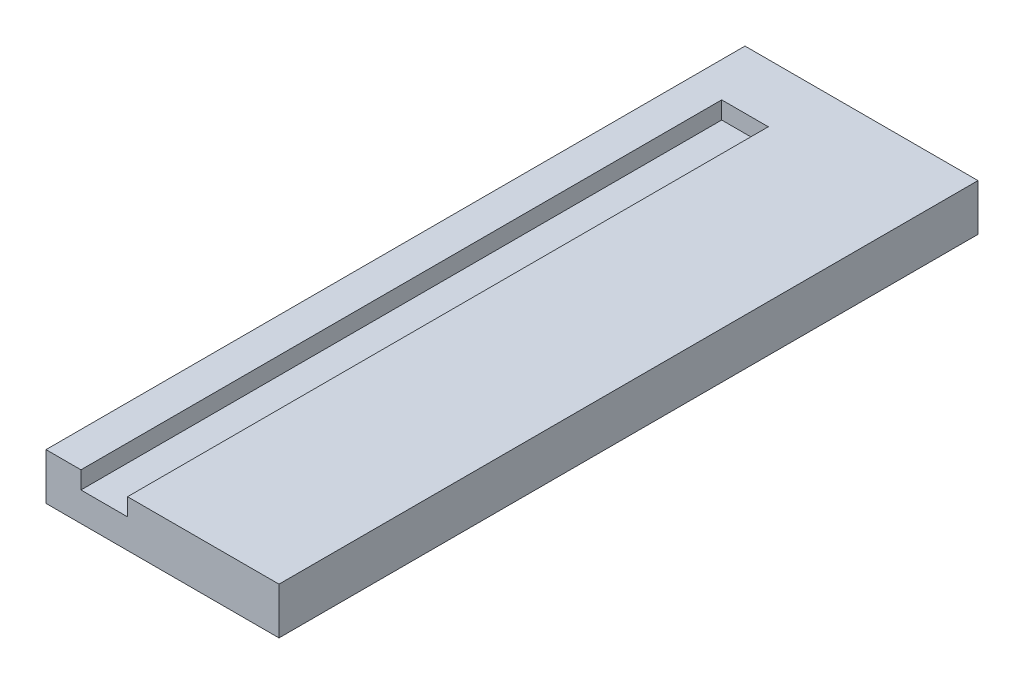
from build123d import *

# Parameters (mm, degrees)
SKETCH1_W           = 200
SKETCH1_H           = 40
BOSS_EXTRUDE1_DEPTH = 600
SKETCH2_W           = 40
SKETCH2_H           = 15
CUT_EXTRUDE1_DEPTH  = 550


with BuildPart() as part:
    # Sketch1 → Boss-Extrude1 (new body)
    with BuildSketch(Plane.XY):
        with Locations((100, -20)):
            Rectangle(SKETCH1_W, SKETCH1_H)
    extrude(amount=-BOSS_EXTRUDE1_DEPTH)

    # Sketch2 → Cut-Extrude1 (cut)
    with BuildSketch(Plane.XY):
        with Locations((50, -7.5)):
            Rectangle(SKETCH2_W, SKETCH2_H)
    extrude(amount=-CUT_EXTRUDE1_DEPTH, mode=Mode.SUBTRACT)


solid = part.part
